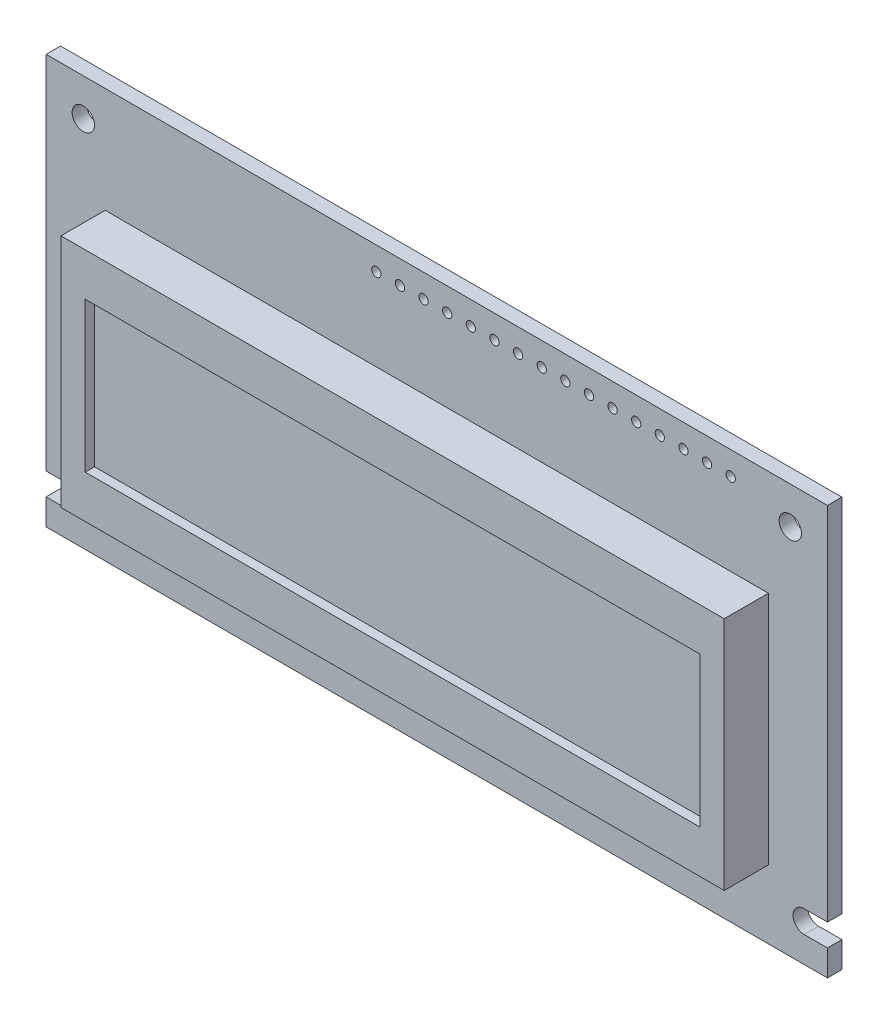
from build123d import *

# Parameters (mm, degrees)
ESQUISSE1_R             = 1.2
ESQUISSE1_R_2           = 0.5
BOSS_EXTRU_1_DEPTH      = 1.55
ESQUISSE2_W             = 71.3
ESQUISSE2_H             = 25.3
BOSS_EXTRU_2_DEPTH      = 4.75
ESQUISSE5_W             = 66.1
ESQUISSE5_H             = 16.1
ENL_V_MAT_EXTRU_2_DEPTH = 1


with BuildPart() as part:
    # Esquisse1 → Boss.-Extru.1 (new body)
    with BuildSketch(Plane.XY):
        with BuildLine():
            Line((-62.900836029, 31.990498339), (21.099163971, 31.990498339))
            Line((21.099163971, 31.990498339), (21.099163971, -6.809501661))
            Line((21.099163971, -6.809501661), (18.599163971, -6.809501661))
            ThreePointArc((18.599163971, -6.809501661), (17.399163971, -8.009501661), (18.599163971, -9.209501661))
            Line((18.599163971, -9.209501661), (21.099163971, -9.209501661))
            Line((21.099163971, -9.209501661), (21.099163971, -12.009501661))
            Line((21.099163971, -12.009501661), (-62.900836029, -12.009501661))
            Line((-62.900836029, -12.009501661), (-62.900836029, -9.209501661))
            Line((-62.900836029, -9.209501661), (-60.400836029, -9.209501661))
            ThreePointArc((-60.400836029, -9.209501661), (-59.200836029, -8.009501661), (-60.400836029, -6.809501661))
            Line((-60.400836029, -6.809501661), (-62.900836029, -6.809501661))
            Line((-62.900836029, -6.809501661), (-62.900836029, 31.990498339))
        make_face()
        with Locations(Location((-58.900836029, 27.990498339, 0), (0, 0, 180))):
            Circle(ESQUISSE1_R, mode=Mode.SUBTRACT)
        with Locations(Location((17.099163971, 27.990498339, 0), (0, 0, 180))):
            Circle(ESQUISSE1_R, mode=Mode.SUBTRACT)
        with Locations((-27.400836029, 29.490498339)):
            Circle(ESQUISSE1_R_2, mode=Mode.SUBTRACT)
        with Locations((-24.860836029, 29.490498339)):
            Circle(ESQUISSE1_R_2, mode=Mode.SUBTRACT)
        with Locations((-22.320836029, 29.490498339)):
            Circle(ESQUISSE1_R_2, mode=Mode.SUBTRACT)
        with Locations((-19.780836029, 29.490498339)):
            Circle(ESQUISSE1_R_2, mode=Mode.SUBTRACT)
        with Locations((-17.240836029, 29.490498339)):
            Circle(ESQUISSE1_R_2, mode=Mode.SUBTRACT)
        with Locations((-14.700836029, 29.490498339)):
            Circle(ESQUISSE1_R_2, mode=Mode.SUBTRACT)
        with Locations((-12.160836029, 29.490498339)):
            Circle(ESQUISSE1_R_2, mode=Mode.SUBTRACT)
        with Locations((-9.620836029, 29.490498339)):
            Circle(ESQUISSE1_R_2, mode=Mode.SUBTRACT)
        with Locations((-7.080836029, 29.490498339)):
            Circle(ESQUISSE1_R_2, mode=Mode.SUBTRACT)
        with Locations((-4.540836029, 29.490498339)):
            Circle(ESQUISSE1_R_2, mode=Mode.SUBTRACT)
        with Locations((-2.000836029, 29.490498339)):
            Circle(ESQUISSE1_R_2, mode=Mode.SUBTRACT)
        with Locations((0.539163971, 29.490498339)):
            Circle(ESQUISSE1_R_2, mode=Mode.SUBTRACT)
        with Locations((3.079163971, 29.490498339)):
            Circle(ESQUISSE1_R_2, mode=Mode.SUBTRACT)
        with Locations((5.619163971, 29.490498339)):
            Circle(ESQUISSE1_R_2, mode=Mode.SUBTRACT)
        with Locations((8.159163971, 29.490498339)):
            Circle(ESQUISSE1_R_2, mode=Mode.SUBTRACT)
        with Locations((10.699163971, 29.490498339)):
            Circle(ESQUISSE1_R_2, mode=Mode.SUBTRACT)
    extrude(amount=BOSS_EXTRU_1_DEPTH)

    # Esquisse2 → Boss.-Extru.2 (add)
    with BuildSketch(Plane.XY.offset(1.55)):
        with Locations((-20.900836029, 7.990498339)):
            Rectangle(ESQUISSE2_W, ESQUISSE2_H)
    extrude(amount=BOSS_EXTRU_2_DEPTH)

    # Esquisse5 → Enl_v. mat.-Extru.2 (cut)
    with BuildSketch(Plane.XY.offset(6.3)):
        with Locations((-20.900836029, 7.990498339)):
            Rectangle(ESQUISSE5_W, ESQUISSE5_H)
    extrude(amount=-ENL_V_MAT_EXTRU_2_DEPTH, mode=Mode.SUBTRACT)


solid = part.part
